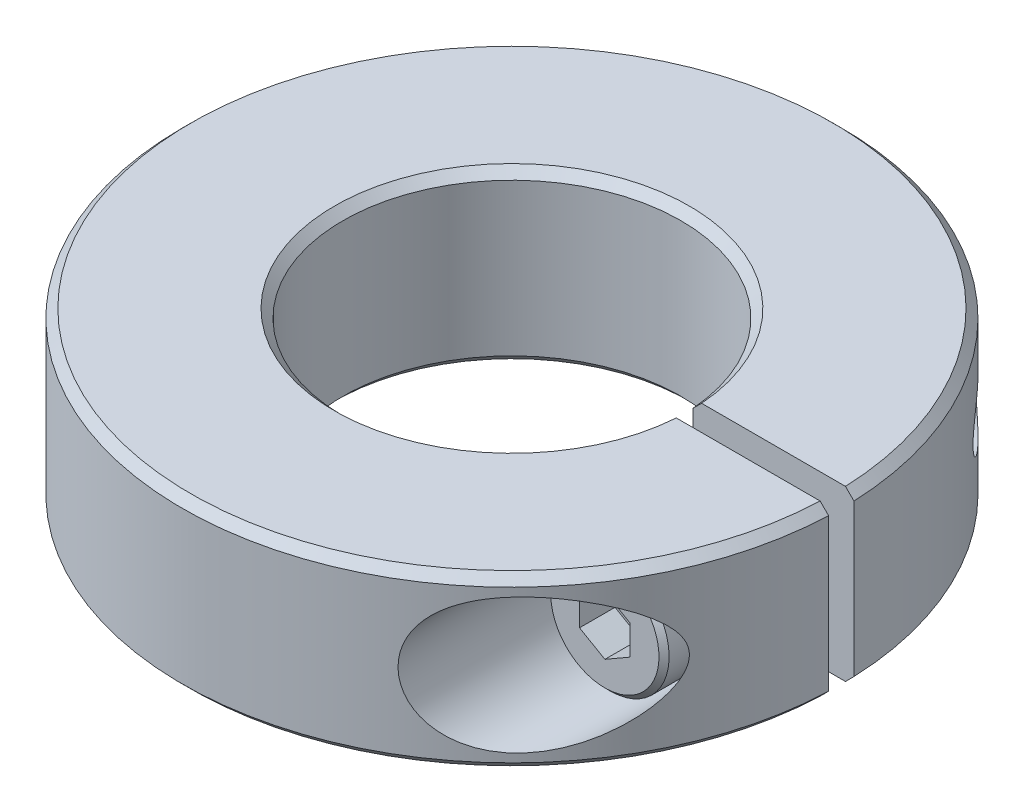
ISO-10303-21;
HEADER;
FILE_DESCRIPTION(('STEP AP214'),'2;1');
FILE_NAME('part.step','',(''),(''),'','','');
FILE_SCHEMA(('AUTOMOTIVE_DESIGN { 1 0 10303 214 1 1 1 1 }'));
ENDSEC;
DATA;
#1=APPLICATION_CONTEXT('core data for automotive mechanical design processes');
#2=APPLICATION_PROTOCOL_DEFINITION('international standard','automotive_design',2000,#1);
#3=PRODUCT_CONTEXT('',#1,'mechanical');
#4=PRODUCT('Part','Part','',(#3));
#5=PRODUCT_RELATED_PRODUCT_CATEGORY('part','',(#4));
#6=PRODUCT_DEFINITION_FORMATION('','',#4);
#7=PRODUCT_DEFINITION_CONTEXT('part definition',#1,'design');
#8=PRODUCT_DEFINITION('design','',#6,#7);
#9=PRODUCT_DEFINITION_SHAPE('','',#8);
#10=(LENGTH_UNIT() NAMED_UNIT(*) SI_UNIT(.MILLI.,.METRE.));
#11=(NAMED_UNIT(*) PLANE_ANGLE_UNIT() SI_UNIT($,.RADIAN.));
#12=(NAMED_UNIT(*) SI_UNIT($,.STERADIAN.) SOLID_ANGLE_UNIT());
#13=UNCERTAINTY_MEASURE_WITH_UNIT(LENGTH_MEASURE(1.E-05),#10,'distance_accuracy_value','');
#14=(GEOMETRIC_REPRESENTATION_CONTEXT(3) GLOBAL_UNCERTAINTY_ASSIGNED_CONTEXT((#13)) GLOBAL_UNIT_ASSIGNED_CONTEXT((#10,
#11,#12)) REPRESENTATION_CONTEXT('',''));
#15=CARTESIAN_POINT('',(0.,0.,0.));
#16=DIRECTION('',(0.,0.,1.));
#17=DIRECTION('',(1.,0.,0.));
#18=AXIS2_PLACEMENT_3D('',#15,#16,#17);
#19=CARTESIAN_POINT('',(16.25,5.,4.5));
#20=DIRECTION('',(0.,0.,-1.));
#21=DIRECTION('',(-1.,0.,0.));
#22=AXIS2_PLACEMENT_3D('',#19,#20,#21);
#23=PLANE('',#22);
#24=CARTESIAN_POINT('',(14.,5.,4.5));
#25=DIRECTION('',(0.,0.,1.));
#26=DIRECTION('',(1.,0.,0.));
#27=AXIS2_PLACEMENT_3D('',#24,#25,#26);
#28=CIRCLE('',#27,3.99999999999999);
#29=CARTESIAN_POINT('',(18.,5.,4.5));
#30=VERTEX_POINT('',#29);
#31=EDGE_CURVE('P0_E19',#30,#30,#28,.T.);
#32=ORIENTED_EDGE('',*,*,#31,.T.);
#33=EDGE_LOOP('',(#32));
#34=FACE_BOUND('',#33,.T.);
#35=CARTESIAN_POINT('',(14.,5.,4.5));
#36=DIRECTION('',(0.,0.,1.));
#37=DIRECTION('',(1.,0.,0.));
#38=AXIS2_PLACEMENT_3D('',#35,#36,#37);
#39=CIRCLE('',#38,2.25);
#40=CARTESIAN_POINT('',(16.25,5.,4.5));
#41=VERTEX_POINT('',#40);
#42=EDGE_CURVE('P0_E387',#41,#41,#39,.F.);
#43=ORIENTED_EDGE('',*,*,#42,.T.);
#44=EDGE_LOOP('',(#43));
#45=FACE_BOUND('',#44,.T.);
#46=ADVANCED_FACE('P0_F16',(#34,#45),#23,.F.);
#47=CARTESIAN_POINT('',(14.,5.,19.5));
#48=DIRECTION('',(0.,0.,1.));
#49=DIRECTION('',(1.,0.,0.));
#50=AXIS2_PLACEMENT_3D('',#47,#48,#49);
#51=CYLINDRICAL_SURFACE('',#50,3.99999999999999);
#52=CARTESIAN_POINT('',(18.,5.,7.50000000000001));
#53=CARTESIAN_POINT('',(17.9999928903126,4.9009382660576,7.50001954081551));
#54=CARTESIAN_POINT('',(17.9962706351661,4.80178356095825,7.50896960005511));
#55=CARTESIAN_POINT('',(17.981845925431,4.60689889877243,7.54344311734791));
#56=CARTESIAN_POINT('',(17.971128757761,4.5111766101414,7.56900150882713));
#57=CARTESIAN_POINT('',(17.9397041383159,4.29738461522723,7.64323621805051));
#58=CARTESIAN_POINT('',(17.9169602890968,4.18126394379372,7.69655608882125));
#59=CARTESIAN_POINT('',(17.8639752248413,3.95942356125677,7.81874776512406));
#60=CARTESIAN_POINT('',(17.8337145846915,3.85373180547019,7.88765982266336));
#61=CARTESIAN_POINT('',(17.7701460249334,3.66003010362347,8.02978809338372));
#62=CARTESIAN_POINT('',(17.7372773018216,3.57128187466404,8.10221554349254));
#63=CARTESIAN_POINT('',(17.6675458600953,3.40074950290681,8.25316573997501));
#64=CARTESIAN_POINT('',(17.6306796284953,3.31897160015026,8.33169383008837));
#65=CARTESIAN_POINT('',(17.5534597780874,3.16134929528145,8.49317865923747));
#66=CARTESIAN_POINT('',(17.5130991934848,3.08551734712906,8.5761441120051));
#67=CARTESIAN_POINT('',(17.4293016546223,2.93917505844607,8.74519021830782));
#68=CARTESIAN_POINT('',(17.3858635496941,2.86866672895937,8.83127203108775));
#69=CARTESIAN_POINT('',(17.2951657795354,2.73089575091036,9.00762393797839));
#70=CARTESIAN_POINT('',(17.2478426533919,2.66374000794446,9.09794459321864));
#71=CARTESIAN_POINT('',(17.1504091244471,2.53392991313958,9.28031089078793));
#72=CARTESIAN_POINT('',(17.1002982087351,2.47127639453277,9.37235684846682));
#73=CARTESIAN_POINT('',(16.9458979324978,2.28945897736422,9.6504639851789));
#74=CARTESIAN_POINT('',(16.8375917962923,2.17651403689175,9.83839514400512));
#75=CARTESIAN_POINT('',(16.6107415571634,1.96552867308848,10.2167537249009));
#76=CARTESIAN_POINT('',(16.4921841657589,1.86750806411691,10.4071841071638));
#77=CARTESIAN_POINT('',(16.2452266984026,1.68602481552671,10.7886157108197));
#78=CARTESIAN_POINT('',(16.116826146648,1.60256288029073,10.979616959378));
#79=CARTESIAN_POINT('',(15.8412778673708,1.44520559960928,11.3739027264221));
#80=CARTESIAN_POINT('',(15.6934483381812,1.37235916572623,11.5771311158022));
#81=CARTESIAN_POINT('',(15.3871134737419,1.24454264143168,11.9812787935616));
#82=CARTESIAN_POINT('',(15.2286052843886,1.18957735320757,12.1821974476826));
#83=CARTESIAN_POINT('',(14.9018854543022,1.09932613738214,12.5797396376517));
#84=CARTESIAN_POINT('',(14.733698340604,1.06399269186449,12.7763724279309));
#85=CARTESIAN_POINT('',(14.3882154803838,1.01506611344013,13.1642161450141));
#86=CARTESIAN_POINT('',(14.2109249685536,1.00146062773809,13.3554300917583));
#87=CARTESIAN_POINT('',(13.9116633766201,0.999230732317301,13.6654539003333));
#88=CARTESIAN_POINT('',(13.791869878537,1.00357014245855,13.7863408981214));
#89=CARTESIAN_POINT('',(13.549654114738,1.02357532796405,14.0244675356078));
#90=CARTESIAN_POINT('',(13.427232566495,1.03923804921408,14.1417081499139));
#91=CARTESIAN_POINT('',(13.1806207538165,1.08282264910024,14.3718349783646));
#92=CARTESIAN_POINT('',(13.0564318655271,1.1107354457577,14.4847243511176));
#93=CARTESIAN_POINT('',(12.8073063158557,1.17976486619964,14.7054631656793));
#94=CARTESIAN_POINT('',(12.68236981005,1.22087883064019,14.8133136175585));
#95=CARTESIAN_POINT('',(12.3580645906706,1.34626283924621,15.0862849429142));
#96=CARTESIAN_POINT('',(12.1590198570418,1.4416249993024,15.2469360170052));
#97=CARTESIAN_POINT('',(11.7697234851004,1.67180332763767,15.5494151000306));
#98=CARTESIAN_POINT('',(11.5794616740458,1.80657245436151,15.6912652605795));
#99=CARTESIAN_POINT('',(11.2473510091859,2.09098974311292,15.9305305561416));
#100=CARTESIAN_POINT('',(11.1027204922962,2.234406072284,16.0314108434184));
#101=CARTESIAN_POINT('',(10.9002175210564,2.46976038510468,16.1691677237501));
#102=CARTESIAN_POINT('',(10.8350925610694,2.55163289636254,16.2128459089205));
#103=CARTESIAN_POINT('',(10.7104840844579,2.72180184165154,16.295431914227));
#104=CARTESIAN_POINT('',(10.6509981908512,2.81009554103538,16.3343417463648));
#105=CARTESIAN_POINT('',(10.5381085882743,2.99327079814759,16.4074015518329));
#106=CARTESIAN_POINT('',(10.4847479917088,3.08819228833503,16.4415181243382));
#107=CARTESIAN_POINT('',(10.3853908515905,3.28343619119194,16.5044574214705));
#108=CARTESIAN_POINT('',(10.3393907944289,3.38375599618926,16.5332826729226));
#109=CARTESIAN_POINT('',(10.255494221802,3.58898912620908,16.585453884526));
#110=CARTESIAN_POINT('',(10.2175898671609,3.69389788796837,16.6088051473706));
#111=CARTESIAN_POINT('',(10.1504652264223,3.90747397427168,16.6499129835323));
#112=CARTESIAN_POINT('',(10.1212419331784,4.01613998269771,16.6676714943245));
#113=CARTESIAN_POINT('',(10.0647196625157,4.26866554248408,16.701881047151));
#114=CARTESIAN_POINT('',(10.0405045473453,4.41349109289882,16.7164175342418));
#115=CARTESIAN_POINT('',(10.0081475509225,4.70556251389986,16.735810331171));
#116=CARTESIAN_POINT('',(10.000003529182,4.85280805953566,16.7406679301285));
#117=CARTESIAN_POINT('',(9.99999761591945,5.09943308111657,16.7406697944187));
#118=CARTESIAN_POINT('',(10.0037101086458,5.19884169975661,16.7384543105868));
#119=CARTESIAN_POINT('',(10.0185057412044,5.39694353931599,16.7296031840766));
#120=CARTESIAN_POINT('',(10.0295903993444,5.49563660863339,16.7229666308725));
#121=CARTESIAN_POINT('',(10.0589939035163,5.69158774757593,16.7052965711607));
#122=CARTESIAN_POINT('',(10.0773164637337,5.78884505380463,16.6942608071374));
#123=CARTESIAN_POINT('',(10.1209591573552,5.98121051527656,16.6678383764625));
#124=CARTESIAN_POINT('',(10.1462819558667,6.07631783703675,16.6524500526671));
#125=CARTESIAN_POINT('',(10.2035204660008,6.26344221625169,16.6174393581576));
#126=CARTESIAN_POINT('',(10.2354183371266,6.35546686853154,16.5978284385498));
#127=CARTESIAN_POINT('',(10.3054424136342,6.53611430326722,16.5544420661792));
#128=CARTESIAN_POINT('',(10.3435709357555,6.62473580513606,16.5306650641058));
#129=CARTESIAN_POINT('',(10.4665943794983,6.88458750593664,16.4532608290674));
#130=CARTESIAN_POINT('',(10.5601911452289,7.05001032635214,16.3935219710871));
#131=CARTESIAN_POINT('',(10.7699171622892,7.36729597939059,16.2565392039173));
#132=CARTESIAN_POINT('',(10.8867362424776,7.51845632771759,16.1787425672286));
#133=CARTESIAN_POINT('',(11.135588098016,7.79825259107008,16.0084789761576));
#134=CARTESIAN_POINT('',(11.2676253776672,7.92688180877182,15.9160076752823));
#135=CARTESIAN_POINT('',(11.5586010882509,8.17496558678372,15.7061963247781));
#136=CARTESIAN_POINT('',(11.7188645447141,8.29145220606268,15.5872026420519));
#137=CARTESIAN_POINT('',(12.0465509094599,8.49591059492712,15.3353623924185));
#138=CARTESIAN_POINT('',(12.2139788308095,8.58386201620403,15.2025060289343));
#139=CARTESIAN_POINT('',(12.5092511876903,8.71441572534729,14.9598009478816));
#140=CARTESIAN_POINT('',(12.6366126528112,8.76285532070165,14.8524196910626));
#141=CARTESIAN_POINT('',(12.8911502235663,8.84556393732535,14.6320393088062));
#142=CARTESIAN_POINT('',(13.0183262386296,8.87982747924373,14.5190380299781));
#143=CARTESIAN_POINT('',(13.2713610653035,8.93521126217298,14.2881197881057));
#144=CARTESIAN_POINT('',(13.397217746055,8.95631273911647,14.1701960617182));
#145=CARTESIAN_POINT('',(13.6465065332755,8.98632767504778,13.9302839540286));
#146=CARTESIAN_POINT('',(13.7699379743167,8.99523783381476,13.8082944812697));
#147=CARTESIAN_POINT('',(14.0583312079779,9.00304390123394,13.5155314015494));
#148=CARTESIAN_POINT('',(14.2219254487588,8.99706976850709,13.343271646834));
#149=CARTESIAN_POINT('',(14.5419226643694,8.96638024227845,12.9937942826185));
#150=CARTESIAN_POINT('',(14.6983227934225,8.94165749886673,12.8165747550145));
#151=CARTESIAN_POINT('',(15.0033802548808,8.87526048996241,12.4580931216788));
#152=CARTESIAN_POINT('',(15.1520213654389,8.83355219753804,12.27682359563));
#153=CARTESIAN_POINT('',(15.4406799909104,8.73466421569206,11.9117403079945));
#154=CARTESIAN_POINT('',(15.5806987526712,8.67748676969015,11.7279269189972));
#155=CARTESIAN_POINT('',(15.8558010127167,8.5468117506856,11.3533756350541));
#156=CARTESIAN_POINT('',(15.9906186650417,8.47288406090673,11.1625929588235));
#157=CARTESIAN_POINT('',(16.2505896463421,8.31034172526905,10.7806175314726));
#158=CARTESIAN_POINT('',(16.3757402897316,8.22172301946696,10.5894246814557));
#159=CARTESIAN_POINT('',(16.6156931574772,8.03012409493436,10.2087800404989));
#160=CARTESIAN_POINT('',(16.7305282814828,7.92719241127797,10.0193245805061));
#161=CARTESIAN_POINT('',(16.9499015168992,7.70598761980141,9.64355030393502));
#162=CARTESIAN_POINT('',(17.0544464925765,7.58772486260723,9.45722946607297));
#163=CARTESIAN_POINT('',(17.2312654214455,7.36111733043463,9.13018411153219));
#164=CARTESIAN_POINT('',(17.3056415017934,7.25611832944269,8.98827872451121));
#165=CARTESIAN_POINT('',(17.4471845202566,7.03332696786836,8.71033939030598));
#166=CARTESIAN_POINT('',(17.5143379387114,6.91551141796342,8.57431672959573));
#167=CARTESIAN_POINT('',(17.6088613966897,6.72659117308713,8.37755418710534));
#168=CARTESIAN_POINT('',(17.6394767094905,6.66121463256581,8.31286323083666));
#169=CARTESIAN_POINT('',(17.6982227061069,6.52597335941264,8.18704586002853));
#170=CARTESIAN_POINT('',(17.7263524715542,6.45610698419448,8.12592076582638));
#171=CARTESIAN_POINT('',(17.7796354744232,6.31158971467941,8.00866382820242));
#172=CARTESIAN_POINT('',(17.8047979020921,6.23695475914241,7.95251670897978));
#173=CARTESIAN_POINT('',(17.8516692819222,6.0822067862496,7.8467347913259));
#174=CARTESIAN_POINT('',(17.8733809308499,6.00209811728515,7.79709491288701));
#175=CARTESIAN_POINT('',(17.9136997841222,5.83131325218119,7.70402960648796));
#176=CARTESIAN_POINT('',(17.9320631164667,5.74029594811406,7.66111197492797));
#177=CARTESIAN_POINT('',(17.9628376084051,5.5521988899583,7.58867824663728));
#178=CARTESIAN_POINT('',(17.975265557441,5.45513712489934,7.55912436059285));
#179=CARTESIAN_POINT('',(17.9893397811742,5.29767335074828,7.5255452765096));
#180=CARTESIAN_POINT('',(17.9933183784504,5.23863065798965,7.51601919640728));
#181=CARTESIAN_POINT('',(17.9986508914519,5.11973673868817,7.50324004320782));
#182=CARTESIAN_POINT('',(18.0000042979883,5.0598853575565,7.49998818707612));
#183=CARTESIAN_POINT('',(18.,5.,7.50000000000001));
#184=B_SPLINE_CURVE_WITH_KNOTS('',3,(#52,#53,#54,#55,#56,#57,#58,#59,#60,#61,#62,#63,#64,#65,
#66,#67,#68,#69,#70,#71,#72,#73,#74,#75,#76,#77,#78,#79,#80,#81,#82,#83,#84,#85,#86,#87,#88,#89,
#90,#91,#92,#93,#94,#95,#96,#97,#98,#99,#100,#101,#102,#103,#104,#105,#106,#107,#108,#109,#110,
#111,#112,#113,#114,#115,#116,#117,#118,#119,#120,#121,#122,#123,#124,#125,#126,#127,#128,#129,
#130,#131,#132,#133,#134,#135,#136,#137,#138,#139,#140,#141,#142,#143,#144,#145,#146,#147,#148,
#149,#150,#151,#152,#153,#154,#155,#156,#157,#158,#159,#160,#161,#162,#163,#164,#165,#166,#167,
#168,#169,#170,#171,#172,#173,#174,#175,#176,#177,#178,#179,#180,#181,#182,#183),.UNSPECIFIED.,
.T.,.F.,(4,2,2,2,2,2,2,2,2,2,2,2,2,2,2,2,2,2,2,2,2,2,2,2,2,2,2,2,2,2,2,2,2,2,2,2,2,2,2,2,2,2,2,
2,2,2,2,2,2,2,2,2,2,2,2,2,2,2,2,2,2,2,2,2,2,4),(0.,0.296915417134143,0.594457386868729,
0.981585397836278,1.36972443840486,1.72672652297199,2.084044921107,2.44209277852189,
2.80027522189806,3.16641505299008,3.5326224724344,4.26544049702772,4.99922312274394,
5.7330412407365,6.51719491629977,7.3015590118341,8.08401622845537,8.86602844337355,
9.37638188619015,9.88659772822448,10.3964359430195,10.9061715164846,11.7217900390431,
12.5364388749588,13.2151984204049,13.5549434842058,13.8945446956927,14.2364059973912,
14.5781036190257,14.9194688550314,15.2607157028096,15.7021491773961,16.1435238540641,
16.4416872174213,16.7399120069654,17.0382900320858,17.3367818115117,17.6344740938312,
17.9322773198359,18.527235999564,19.1436117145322,19.7601703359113,20.4509423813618,
21.142205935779,21.6620013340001,22.1819974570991,22.7027332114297,23.2236099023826,
23.9354819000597,24.6476331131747,25.3612180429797,26.0746995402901,26.8091423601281,
27.5437884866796,28.276001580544,29.0077228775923,29.5819196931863,30.1571732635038,
30.4478222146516,30.7385781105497,31.0284084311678,31.3180111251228,31.6239326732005,
31.9289836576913,32.1084418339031,32.2879348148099),.UNSPECIFIED.);
#185=CARTESIAN_POINT('',(18.,5.,7.50000000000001));
#186=VERTEX_POINT('',#185);
#187=EDGE_CURVE('P0_E390',#186,#186,#184,.T.);
#188=ORIENTED_EDGE('',*,*,#187,.F.);
#189=EDGE_LOOP('',(#188));
#190=FACE_BOUND('',#189,.T.);
#191=ORIENTED_EDGE('',*,*,#31,.F.);
#192=EDGE_LOOP('',(#191));
#193=FACE_BOUND('',#192,.T.);
#194=ADVANCED_FACE('P0_F194',(#190,#193),#51,.F.);
#195=CARTESIAN_POINT('',(0.,0.500000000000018,0.));
#196=DIRECTION('',(0.,1.,0.));
#197=DIRECTION('',(0.,0.,1.));
#198=AXIS2_PLACEMENT_3D('',#195,#196,#197);
#199=CONICAL_SURFACE('',#198,19.5,0.785398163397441);
#200=CARTESIAN_POINT('',(0.,0.500000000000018,0.));
#201=DIRECTION('',(0.,-1.,0.));
#202=DIRECTION('',(0.,0.,-1.));
#203=AXIS2_PLACEMENT_3D('',#200,#201,#202);
#204=CIRCLE('',#203,19.5);
#205=CARTESIAN_POINT('',(19.4855715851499,0.500000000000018,-0.75));
#206=VERTEX_POINT('',#205);
#207=CARTESIAN_POINT('',(19.4855715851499,0.500000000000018,0.75));
#208=VERTEX_POINT('',#207);
#209=EDGE_CURVE('P0_E396',#206,#208,#204,.F.);
#210=ORIENTED_EDGE('',*,*,#209,.F.);
#211=CARTESIAN_POINT('',(19.4855715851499,0.500000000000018,-0.75));
#212=CARTESIAN_POINT('',(19.4021757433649,0.416665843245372,-0.75));
#213=CARTESIAN_POINT('',(19.3187794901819,0.333332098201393,-0.75));
#214=CARTESIAN_POINT('',(19.1519861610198,0.166665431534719,-0.75));
#215=CARTESIAN_POINT('',(19.0685890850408,0.0833325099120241,-0.75));
#216=CARTESIAN_POINT('',(18.9851915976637,0.,-0.75));
#217=B_SPLINE_CURVE_WITH_KNOTS('',3,(#211,#212,#213,#214,#215,#216),.UNSPECIFIED.,.F.,.F.,(4,2,
4),(0.,0.353687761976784,0.70737552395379),.UNSPECIFIED.);
#218=CARTESIAN_POINT('',(18.9851915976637,0.,-0.75));
#219=VERTEX_POINT('',#218);
#220=EDGE_CURVE('P0_E177',#206,#219,#217,.T.);
#221=ORIENTED_EDGE('',*,*,#220,.T.);
#222=CARTESIAN_POINT('',(0.,0.,0.));
#223=DIRECTION('',(0.,1.,0.));
#224=DIRECTION('',(0.,0.,1.));
#225=AXIS2_PLACEMENT_3D('',#222,#223,#224);
#226=CIRCLE('',#225,19.);
#227=CARTESIAN_POINT('',(18.9851915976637,0.,0.75));
#228=VERTEX_POINT('',#227);
#229=EDGE_CURVE('P0_E91',#228,#219,#226,.F.);
#230=ORIENTED_EDGE('',*,*,#229,.F.);
#231=CARTESIAN_POINT('',(18.9851915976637,0.,0.75));
#232=CARTESIAN_POINT('',(19.0685890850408,0.083332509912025,0.75));
#233=CARTESIAN_POINT('',(19.1519861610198,0.16666543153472,0.75));
#234=CARTESIAN_POINT('',(19.3187794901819,0.333332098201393,0.75));
#235=CARTESIAN_POINT('',(19.4021757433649,0.416665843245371,0.75));
#236=CARTESIAN_POINT('',(19.4855715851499,0.500000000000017,0.75));
#237=B_SPLINE_CURVE_WITH_KNOTS('',3,(#231,#232,#233,#234,#235,#236),.UNSPECIFIED.,.F.,.F.,(4,2,
4),(0.,0.353687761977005,0.707375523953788),.UNSPECIFIED.);
#238=EDGE_CURVE('P0_E197',#228,#208,#237,.T.);
#239=ORIENTED_EDGE('',*,*,#238,.T.);
#240=EDGE_LOOP('',(#210,#221,#230,#239));
#241=FACE_BOUND('',#240,.T.);
#242=ADVANCED_FACE('P0_F191',(#241),#199,.T.);
#243=CARTESIAN_POINT('',(0.,0.,0.));
#244=DIRECTION('',(0.,-1.,0.));
#245=DIRECTION('',(0.,0.,-1.));
#246=AXIS2_PLACEMENT_3D('',#243,#244,#245);
#247=CONICAL_SURFACE('',#246,10.5,0.785398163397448);
#248=CARTESIAN_POINT('',(0.,0.500000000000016,0.));
#249=DIRECTION('',(0.,-1.,0.));
#250=DIRECTION('',(0.,0.,-1.));
#251=AXIS2_PLACEMENT_3D('',#248,#249,#250);
#252=CIRCLE('',#251,10.);
#253=CARTESIAN_POINT('',(9.97183533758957,0.500000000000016,-0.75));
#254=VERTEX_POINT('',#253);
#255=CARTESIAN_POINT('',(9.97183533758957,0.500000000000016,0.75));
#256=VERTEX_POINT('',#255);
#257=EDGE_CURVE('P0_E403',#254,#256,#252,.F.);
#258=ORIENTED_EDGE('',*,*,#257,.T.);
#259=CARTESIAN_POINT('',(10.4731800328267,0.,0.75));
#260=CARTESIAN_POINT('',(10.3896280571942,0.083338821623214,0.75));
#261=CARTESIAN_POINT('',(10.306073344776,0.166674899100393,0.75));
#262=CARTESIAN_POINT('',(10.1389584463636,0.333341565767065,0.75));
#263=CARTESIAN_POINT('',(10.0553982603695,0.416672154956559,0.75));
#264=CARTESIAN_POINT('',(9.97183533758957,0.500000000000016,0.75));
#265=B_SPLINE_CURVE_WITH_KNOTS('',3,(#259,#260,#261,#262,#263,#264),.UNSPECIFIED.,.F.,.F.,(4,2,
4),(0.,0.354029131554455,0.708058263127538),.UNSPECIFIED.);
#266=CARTESIAN_POINT('',(10.4731800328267,0.,0.75));
#267=VERTEX_POINT('',#266);
#268=EDGE_CURVE('P0_E167',#267,#256,#265,.T.);
#269=ORIENTED_EDGE('',*,*,#268,.F.);
#270=CARTESIAN_POINT('',(0.,0.,0.));
#271=DIRECTION('',(0.,-1.,0.));
#272=DIRECTION('',(0.,0.,-1.));
#273=AXIS2_PLACEMENT_3D('',#270,#271,#272);
#274=CIRCLE('',#273,10.5);
#275=CARTESIAN_POINT('',(10.4731800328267,0.,-0.75));
#276=VERTEX_POINT('',#275);
#277=EDGE_CURVE('P0_E397',#276,#267,#274,.F.);
#278=ORIENTED_EDGE('',*,*,#277,.F.);
#279=CARTESIAN_POINT('',(9.97183533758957,0.500000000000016,-0.75));
#280=CARTESIAN_POINT('',(10.0553982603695,0.416672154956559,-0.75));
#281=CARTESIAN_POINT('',(10.1389584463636,0.333341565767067,-0.75));
#282=CARTESIAN_POINT('',(10.306073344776,0.166674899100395,-0.75));
#283=CARTESIAN_POINT('',(10.3896280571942,0.0833388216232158,-0.75));
#284=CARTESIAN_POINT('',(10.4731800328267,0.,-0.75));
#285=B_SPLINE_CURVE_WITH_KNOTS('',3,(#279,#280,#281,#282,#283,#284),.UNSPECIFIED.,.F.,.F.,(4,2,
4),(0.,0.35402913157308,0.708058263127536),.UNSPECIFIED.);
#286=EDGE_CURVE('P0_E176',#254,#276,#285,.T.);
#287=ORIENTED_EDGE('',*,*,#286,.F.);
#288=EDGE_LOOP('',(#258,#269,#278,#287));
#289=FACE_BOUND('',#288,.T.);
#290=ADVANCED_FACE('P0_F188',(#289),#247,.F.);
#291=CARTESIAN_POINT('',(14.,5.,-0.75));
#292=DIRECTION('',(0.,0.,1.));
#293=DIRECTION('',(1.,0.,0.));
#294=AXIS2_PLACEMENT_3D('',#291,#292,#293);
#295=CYLINDRICAL_SURFACE('',#294,1.64999999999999);
#296=CARTESIAN_POINT('',(15.65,4.99999999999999,-11.6330348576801));
#297=CARTESIAN_POINT('',(15.6499958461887,5.06804301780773,-11.6330409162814));
#298=CARTESIAN_POINT('',(15.6457415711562,5.13611230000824,-11.6387703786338));
#299=CARTESIAN_POINT('',(15.6292362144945,5.26949905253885,-11.6609241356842));
#300=CARTESIAN_POINT('',(15.6169723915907,5.3348119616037,-11.6773654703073));
#301=CARTESIAN_POINT('',(15.5858746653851,5.46002829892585,-11.7188379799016));
#302=CARTESIAN_POINT('',(15.5671153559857,5.51998381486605,-11.7437715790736));
#303=CARTESIAN_POINT('',(15.5243246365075,5.63457184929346,-11.8002798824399));
#304=CARTESIAN_POINT('',(15.5002909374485,5.68920204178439,-11.8318574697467));
#305=CARTESIAN_POINT('',(15.4323926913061,5.82426871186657,-11.9203995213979));
#306=CARTESIAN_POINT('',(15.3852818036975,5.9005219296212,-11.9812281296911));
#307=CARTESIAN_POINT('',(15.2835721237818,6.04041053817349,-12.1107082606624));
#308=CARTESIAN_POINT('',(15.2289513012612,6.10400740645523,-12.1793826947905));
#309=CARTESIAN_POINT('',(15.1275078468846,6.20628791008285,-12.3050169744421));
#310=CARTESIAN_POINT('',(15.0818125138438,6.24732927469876,-12.3610022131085));
#311=CARTESIAN_POINT('',(14.987701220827,6.32310121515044,-12.4749464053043));
#312=CARTESIAN_POINT('',(14.939283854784,6.35782848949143,-12.532906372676));
#313=CARTESIAN_POINT('',(14.7905642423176,6.45306400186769,-12.7087640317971));
#314=CARTESIAN_POINT('',(14.6867862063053,6.50463396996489,-12.828649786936));
#315=CARTESIAN_POINT('',(14.4685387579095,6.58652146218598,-13.0743822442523));
#316=CARTESIAN_POINT('',(14.3538147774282,6.61597311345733,-13.2002843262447));
#317=CARTESIAN_POINT('',(14.1193438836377,6.64992965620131,-13.4507801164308));
#318=CARTESIAN_POINT('',(13.9995994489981,6.65444671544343,-13.5753744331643));
#319=CARTESIAN_POINT('',(13.7697872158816,6.63750734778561,-13.8082236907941));
#320=CARTESIAN_POINT('',(13.6599377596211,6.61858286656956,-13.9168734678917));
#321=CARTESIAN_POINT('',(13.4412098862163,6.5566438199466,-14.1282294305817));
#322=CARTESIAN_POINT('',(13.3323304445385,6.51365878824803,-14.2309427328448));
#323=CARTESIAN_POINT('',(13.1475236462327,6.41552638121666,-14.4015331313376));
#324=CARTESIAN_POINT('',(13.0703656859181,6.36641289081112,-14.4715425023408));
#325=CARTESIAN_POINT('',(12.9217071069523,6.25240905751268,-14.6044295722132));
#326=CARTESIAN_POINT('',(12.8501989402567,6.18754025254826,-14.6673168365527));
#327=CARTESIAN_POINT('',(12.7304051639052,6.05677422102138,-14.7713145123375));
#328=CARTESIAN_POINT('',(12.6803860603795,5.99391051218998,-14.8142316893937));
#329=CARTESIAN_POINT('',(12.588410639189,5.85825809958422,-14.8924664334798));
#330=CARTESIAN_POINT('',(12.5464477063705,5.78547762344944,-14.9277902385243));
#331=CARTESIAN_POINT('',(12.4785529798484,5.64264633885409,-14.9845715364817));
#332=CARTESIAN_POINT('',(12.4511652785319,5.57379865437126,-15.0073098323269));
#333=CARTESIAN_POINT('',(12.4055781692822,5.4311582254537,-15.0450162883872));
#334=CARTESIAN_POINT('',(12.3873627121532,5.35737437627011,-15.0599980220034));
#335=CARTESIAN_POINT('',(12.366268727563,5.23587415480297,-15.077317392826));
#336=CARTESIAN_POINT('',(12.3601854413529,5.18905904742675,-15.0823023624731));
#337=CARTESIAN_POINT('',(12.3520489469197,5.09483755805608,-15.0889666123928));
#338=CARTESIAN_POINT('',(12.3499964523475,5.04743107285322,-15.0906453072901));
#339=CARTESIAN_POINT('',(12.3500057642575,4.92293356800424,-15.0906387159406));
#340=CARTESIAN_POINT('',(12.3554394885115,4.84580222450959,-15.0861962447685));
#341=CARTESIAN_POINT('',(12.3768097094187,4.69397528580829,-15.0686681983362));
#342=CARTESIAN_POINT('',(12.3927599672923,4.61928301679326,-15.0555712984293));
#343=CARTESIAN_POINT('',(12.434009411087,4.47484307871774,-15.0215216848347));
#344=CARTESIAN_POINT('',(12.4592649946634,4.40507412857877,-15.0006056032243));
#345=CARTESIAN_POINT('',(12.517696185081,4.27158302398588,-14.951880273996));
#346=CARTESIAN_POINT('',(12.5508721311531,4.207861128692,-14.9240707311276));
#347=CARTESIAN_POINT('',(12.6260732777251,4.0832253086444,-14.8605130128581));
#348=CARTESIAN_POINT('',(12.6685453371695,4.02279306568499,-14.8243550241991));
#349=CARTESIAN_POINT('',(12.7590115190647,3.91019549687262,-14.746565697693));
#350=CARTESIAN_POINT('',(12.8070087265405,3.85803482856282,-14.7049313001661));
#351=CARTESIAN_POINT('',(12.9334923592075,3.73655331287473,-14.5940070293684));
#352=CARTESIAN_POINT('',(13.0146805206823,3.67274293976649,-14.521734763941));
#353=CARTESIAN_POINT('',(13.1822837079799,3.56337171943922,-14.3697703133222));
#354=CARTESIAN_POINT('',(13.2687104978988,3.51785384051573,-14.2900611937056));
#355=CARTESIAN_POINT('',(13.4726233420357,3.43145140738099,-14.0983619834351));
#356=CARTESIAN_POINT('',(13.5909693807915,3.39702292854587,-13.9843820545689));
#357=CARTESIAN_POINT('',(13.826970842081,3.35471500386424,-13.7510925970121));
#358=CARTESIAN_POINT('',(13.9446256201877,3.34685730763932,-13.6317787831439));
#359=CARTESIAN_POINT('',(14.1787038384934,3.35544725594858,-13.3881833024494));
#360=CARTESIAN_POINT('',(14.2950538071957,3.37239150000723,-13.2638499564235));
#361=CARTESIAN_POINT('',(14.5217446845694,3.43029083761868,-13.0152696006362));
#362=CARTESIAN_POINT('',(14.6320845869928,3.47124993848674,-12.8910226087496));
#363=CARTESIAN_POINT('',(14.831356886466,3.57095426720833,-12.6610033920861));
#364=CARTESIAN_POINT('',(14.9212465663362,3.62686113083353,-12.5548520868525));
#365=CARTESIAN_POINT('',(15.0496480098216,3.72577734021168,-12.4001055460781));
#366=CARTESIAN_POINT('',(15.0913609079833,3.76124153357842,-12.349289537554));
#367=CARTESIAN_POINT('',(15.1722764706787,3.83752007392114,-12.2497399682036));
#368=CARTESIAN_POINT('',(15.2114804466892,3.87833159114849,-12.2010053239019));
#369=CARTESIAN_POINT('',(15.2952568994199,3.97540785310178,-12.0958906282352));
#370=CARTESIAN_POINT('',(15.3390910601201,4.0330923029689,-12.0402128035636));
#371=CARTESIAN_POINT('',(15.4208429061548,4.15782932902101,-11.9353260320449));
#372=CARTESIAN_POINT('',(15.458768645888,4.22486891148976,-11.8861082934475));
#373=CARTESIAN_POINT('',(15.5184487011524,4.3515641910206,-11.808029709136));
#374=CARTESIAN_POINT('',(15.5419002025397,4.40913748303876,-11.777117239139));
#375=CARTESIAN_POINT('',(15.5828462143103,4.52974995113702,-11.7228861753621));
#376=CARTESIAN_POINT('',(15.6003494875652,4.5927809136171,-11.6995564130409));
#377=CARTESIAN_POINT('',(15.6257841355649,4.71283082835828,-11.6655583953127));
#378=CARTESIAN_POINT('',(15.6347952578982,4.76921109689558,-11.6534663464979));
#379=CARTESIAN_POINT('',(15.6469031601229,4.88372191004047,-11.6372044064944));
#380=CARTESIAN_POINT('',(15.6500035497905,4.9418513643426,-11.633029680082));
#381=CARTESIAN_POINT('',(15.65,4.99999999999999,-11.6330348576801));
#382=B_SPLINE_CURVE_WITH_KNOTS('',3,(#296,#297,#298,#299,#300,#301,#302,#303,#304,#305,#306,
#307,#308,#309,#310,#311,#312,#313,#314,#315,#316,#317,#318,#319,#320,#321,#322,#323,#324,#325,
#326,#327,#328,#329,#330,#331,#332,#333,#334,#335,#336,#337,#338,#339,#340,#341,#342,#343,#344,
#345,#346,#347,#348,#349,#350,#351,#352,#353,#354,#355,#356,#357,#358,#359,#360,#361,#362,#363,
#364,#365,#366,#367,#368,#369,#370,#371,#372,#373,#374,#375,#376,#377,#378,#379,#380,#381),
.UNSPECIFIED.,.T.,.F.,(4,2,2,2,2,2,2,2,2,2,2,2,2,2,2,2,2,2,2,2,2,2,2,2,2,2,2,2,2,2,2,2,2,2,2,2,
2,2,2,2,2,2,4),(0.,0.20383158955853,0.407988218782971,0.609874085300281,0.811847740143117,
1.13500640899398,1.45913412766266,1.70812765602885,1.95725100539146,2.4554518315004,
2.9722634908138,3.48882293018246,3.95414324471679,4.41889363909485,4.76326883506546,
5.10717588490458,5.37938935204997,5.65137833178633,5.88292648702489,6.11406806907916,
6.25621538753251,6.39838787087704,6.62939099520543,6.86069699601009,7.09093266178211,
7.32117819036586,7.56700180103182,7.81296334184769,8.18898364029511,8.56588210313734,
9.06683257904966,9.56819301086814,10.0797303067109,10.5913529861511,11.0394777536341,
11.2633610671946,11.4871263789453,11.7605302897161,12.0335581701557,12.2411358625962,
12.4484064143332,12.6227045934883,12.7968962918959),.UNSPECIFIED.);
#383=CARTESIAN_POINT('',(15.65,4.99999999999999,-11.6330348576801));
#384=VERTEX_POINT('',#383);
#385=EDGE_CURVE('P0_E381',#384,#384,#382,.T.);
#386=ORIENTED_EDGE('',*,*,#385,.F.);
#387=EDGE_LOOP('',(#386));
#388=FACE_BOUND('',#387,.T.);
#389=CARTESIAN_POINT('',(14.,5.,-0.749999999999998));
#390=DIRECTION('',(0.,0.,1.));
#391=DIRECTION('',(1.,0.,0.));
#392=AXIS2_PLACEMENT_3D('',#389,#390,#391);
#393=CIRCLE('',#392,1.64999999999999);
#394=CARTESIAN_POINT('',(15.65,5.,-0.749999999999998));
#395=VERTEX_POINT('',#394);
#396=EDGE_CURVE('P0_E404',#395,#395,#393,.T.);
#397=ORIENTED_EDGE('',*,*,#396,.T.);
#398=EDGE_LOOP('',(#397));
#399=FACE_BOUND('',#398,.T.);
#400=ADVANCED_FACE('P0_F280',(#388,#399),#295,.F.);
#401=CARTESIAN_POINT('',(14.,5.,19.5));
#402=DIRECTION('',(0.,0.,1.));
#403=DIRECTION('',(1.,0.,0.));
#404=AXIS2_PLACEMENT_3D('',#401,#402,#403);
#405=CYLINDRICAL_SURFACE('',#404,2.25);
#406=CARTESIAN_POINT('',(14.,5.,0.750000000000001));
#407=DIRECTION('',(0.,0.,1.));
#408=DIRECTION('',(1.,0.,0.));
#409=AXIS2_PLACEMENT_3D('',#406,#407,#408);
#410=CIRCLE('',#409,2.25);
#411=CARTESIAN_POINT('',(16.25,5.,0.750000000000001));
#412=VERTEX_POINT('',#411);
#413=EDGE_CURVE('P0_E414',#412,#412,#410,.F.);
#414=ORIENTED_EDGE('',*,*,#413,.T.);
#415=EDGE_LOOP('',(#414));
#416=FACE_BOUND('',#415,.T.);
#417=ORIENTED_EDGE('',*,*,#42,.F.);
#418=EDGE_LOOP('',(#417));
#419=FACE_BOUND('',#418,.T.);
#420=ADVANCED_FACE('P0_F243',(#416,#419),#405,.F.);
#421=CARTESIAN_POINT('',(0.,0.,0.));
#422=DIRECTION('',(0.,-1.,0.));
#423=DIRECTION('',(0.,0.,-1.));
#424=AXIS2_PLACEMENT_3D('',#421,#422,#423);
#425=CYLINDRICAL_SURFACE('',#424,19.5);
#426=ORIENTED_EDGE('',*,*,#209,.T.);
#427=DIRECTION('',(0.,1.,0.));
#428=VECTOR('',#427,1.);
#429=CARTESIAN_POINT('',(19.4855715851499,0.,0.75));
#430=LINE('',#429,#428);
#431=CARTESIAN_POINT('',(19.4855715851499,9.49999999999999,0.75));
#432=VERTEX_POINT('',#431);
#433=EDGE_CURVE('P0_E416',#208,#432,#430,.T.);
#434=ORIENTED_EDGE('',*,*,#433,.T.);
#435=CARTESIAN_POINT('',(0.,9.49999999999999,0.));
#436=DIRECTION('',(0.,-1.,0.));
#437=DIRECTION('',(0.,0.,-1.));
#438=AXIS2_PLACEMENT_3D('',#435,#436,#437);
#439=CIRCLE('',#438,19.5);
#440=CARTESIAN_POINT('',(19.4855715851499,9.49999999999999,-0.75));
#441=VERTEX_POINT('',#440);
#442=EDGE_CURVE('P0_E413',#441,#432,#439,.F.);
#443=ORIENTED_EDGE('',*,*,#442,.F.);
#444=DIRECTION('',(0.,1.,0.));
#445=VECTOR('',#444,1.);
#446=CARTESIAN_POINT('',(19.4855715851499,0.,-0.75));
#447=LINE('',#446,#445);
#448=EDGE_CURVE('P0_E408',#441,#206,#447,.F.);
#449=ORIENTED_EDGE('',*,*,#448,.T.);
#450=EDGE_LOOP('',(#426,#434,#443,#449));
#451=FACE_BOUND('',#450,.T.);
#452=ORIENTED_EDGE('',*,*,#187,.T.);
#453=EDGE_LOOP('',(#452));
#454=FACE_BOUND('',#453,.T.);
#455=ORIENTED_EDGE('',*,*,#385,.T.);
#456=EDGE_LOOP('',(#455));
#457=FACE_BOUND('',#456,.T.);
#458=ADVANCED_FACE('P0_F240',(#451,#454,#457),#425,.T.);
#459=CARTESIAN_POINT('',(10.,0.,0.));
#460=DIRECTION('',(0.,-1.,0.));
#461=DIRECTION('',(0.,0.,-1.));
#462=AXIS2_PLACEMENT_3D('',#459,#460,#461);
#463=PLANE('',#462);
#464=DIRECTION('',(1.,0.,0.));
#465=VECTOR('',#464,1.);
#466=CARTESIAN_POINT('',(0.,0.,0.75));
#467=LINE('',#466,#465);
#468=EDGE_CURVE('P0_E133',#267,#228,#467,.T.);
#469=ORIENTED_EDGE('',*,*,#468,.T.);
#470=ORIENTED_EDGE('',*,*,#229,.T.);
#471=DIRECTION('',(-1.,0.,0.));
#472=VECTOR('',#471,1.);
#473=CARTESIAN_POINT('',(0.,0.,-0.75));
#474=LINE('',#473,#472);
#475=EDGE_CURVE('P0_E439',#219,#276,#474,.T.);
#476=ORIENTED_EDGE('',*,*,#475,.T.);
#477=ORIENTED_EDGE('',*,*,#277,.T.);
#478=EDGE_LOOP('',(#469,#470,#476,#477));
#479=FACE_BOUND('',#478,.T.);
#480=ADVANCED_FACE('P0_F242',(#479),#463,.T.);
#481=CARTESIAN_POINT('',(0.,0.,0.));
#482=DIRECTION('',(0.,-1.,0.));
#483=DIRECTION('',(0.,0.,-1.));
#484=AXIS2_PLACEMENT_3D('',#481,#482,#483);
#485=CYLINDRICAL_SURFACE('',#484,10.);
#486=CARTESIAN_POINT('',(0.,9.5,0.));
#487=DIRECTION('',(0.,1.,0.));
#488=DIRECTION('',(0.,0.,1.));
#489=AXIS2_PLACEMENT_3D('',#486,#487,#488);
#490=CIRCLE('',#489,10.);
#491=CARTESIAN_POINT('',(9.97183533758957,9.5,-0.75));
#492=VERTEX_POINT('',#491);
#493=CARTESIAN_POINT('',(9.97183533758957,9.5,0.75));
#494=VERTEX_POINT('',#493);
#495=EDGE_CURVE('P0_E99',#492,#494,#490,.T.);
#496=ORIENTED_EDGE('',*,*,#495,.T.);
#497=DIRECTION('',(0.,1.,0.));
#498=VECTOR('',#497,1.);
#499=CARTESIAN_POINT('',(9.97183533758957,0.,0.75));
#500=LINE('',#499,#498);
#501=EDGE_CURVE('P0_E447',#494,#256,#500,.F.);
#502=ORIENTED_EDGE('',*,*,#501,.T.);
#503=ORIENTED_EDGE('',*,*,#257,.F.);
#504=DIRECTION('',(0.,1.,0.));
#505=VECTOR('',#504,1.);
#506=CARTESIAN_POINT('',(9.97183533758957,0.,-0.75));
#507=LINE('',#506,#505);
#508=EDGE_CURVE('P0_E103',#254,#492,#507,.T.);
#509=ORIENTED_EDGE('',*,*,#508,.T.);
#510=EDGE_LOOP('',(#496,#502,#503,#509));
#511=FACE_BOUND('',#510,.T.);
#512=ADVANCED_FACE('P0_F235',(#511),#485,.F.);
#513=CARTESIAN_POINT('',(0.,0.,-0.75));
#514=DIRECTION('',(0.,0.,-1.));
#515=DIRECTION('',(-1.,0.,0.));
#516=AXIS2_PLACEMENT_3D('',#513,#514,#515);
#517=PLANE('',#516);
#518=ORIENTED_EDGE('',*,*,#396,.F.);
#519=EDGE_LOOP('',(#518));
#520=FACE_BOUND('',#519,.T.);
#521=ORIENTED_EDGE('',*,*,#448,.F.);
#522=CARTESIAN_POINT('',(18.9851915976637,10.,-0.75));
#523=CARTESIAN_POINT('',(19.0685890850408,9.91666749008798,-0.75));
#524=CARTESIAN_POINT('',(19.1519861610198,9.83333456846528,-0.75));
#525=CARTESIAN_POINT('',(19.3187794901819,9.66666790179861,-0.75));
#526=CARTESIAN_POINT('',(19.4021757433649,9.58333415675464,-0.75));
#527=CARTESIAN_POINT('',(19.4855715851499,9.49999999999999,-0.75));
#528=B_SPLINE_CURVE_WITH_KNOTS('',3,(#522,#523,#524,#525,#526,#527),.UNSPECIFIED.,.F.,.F.,(4,2,
4),(0.,0.353687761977,0.707375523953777),.UNSPECIFIED.);
#529=CARTESIAN_POINT('',(18.9851915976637,10.,-0.75));
#530=VERTEX_POINT('',#529);
#531=EDGE_CURVE('P0_E119',#530,#441,#528,.T.);
#532=ORIENTED_EDGE('',*,*,#531,.F.);
#533=DIRECTION('',(1.,0.,0.));
#534=VECTOR('',#533,1.);
#535=CARTESIAN_POINT('',(10.,10.,-0.75));
#536=LINE('',#535,#534);
#537=CARTESIAN_POINT('',(10.4731800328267,10.,-0.75));
#538=VERTEX_POINT('',#537);
#539=EDGE_CURVE('P0_E111',#538,#530,#536,.T.);
#540=ORIENTED_EDGE('',*,*,#539,.F.);
#541=CARTESIAN_POINT('',(10.4731800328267,10.,-0.75));
#542=CARTESIAN_POINT('',(10.3896280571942,9.91666117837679,-0.75));
#543=CARTESIAN_POINT('',(10.306073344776,9.83332510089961,-0.75));
#544=CARTESIAN_POINT('',(10.1389584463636,9.66665843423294,-0.75));
#545=CARTESIAN_POINT('',(10.0553982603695,9.58332784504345,-0.75));
#546=CARTESIAN_POINT('',(9.97183533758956,9.5,-0.75));
#547=B_SPLINE_CURVE_WITH_KNOTS('',3,(#541,#542,#543,#544,#545,#546),.UNSPECIFIED.,.F.,.F.,(4,2,
4),(0.,0.354029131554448,0.708058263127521),.UNSPECIFIED.);
#548=EDGE_CURVE('P0_E117',#538,#492,#547,.T.);
#549=ORIENTED_EDGE('',*,*,#548,.T.);
#550=ORIENTED_EDGE('',*,*,#508,.F.);
#551=ORIENTED_EDGE('',*,*,#286,.T.);
#552=ORIENTED_EDGE('',*,*,#475,.F.);
#553=ORIENTED_EDGE('',*,*,#220,.F.);
#554=EDGE_LOOP('',(#521,#532,#540,#549,#550,#551,#552,#553));
#555=FACE_BOUND('',#554,.T.);
#556=ADVANCED_FACE('P0_F116',(#520,#555),#517,.F.);
#557=CARTESIAN_POINT('',(0.,9.49999999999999,0.));
#558=DIRECTION('',(0.,-1.,0.));
#559=DIRECTION('',(0.,0.,-1.));
#560=AXIS2_PLACEMENT_3D('',#557,#558,#559);
#561=CONICAL_SURFACE('',#560,19.5,0.785398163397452);
#562=ORIENTED_EDGE('',*,*,#442,.T.);
#563=CARTESIAN_POINT('',(19.4855715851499,9.5,0.75));
#564=CARTESIAN_POINT('',(19.4021757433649,9.58333415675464,0.75));
#565=CARTESIAN_POINT('',(19.3187794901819,9.66666790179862,0.75));
#566=CARTESIAN_POINT('',(19.1519861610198,9.83333456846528,0.75));
#567=CARTESIAN_POINT('',(19.0685890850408,9.91666749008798,0.75));
#568=CARTESIAN_POINT('',(18.9851915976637,10.,0.75));
#569=B_SPLINE_CURVE_WITH_KNOTS('',3,(#563,#564,#565,#566,#567,#568),.UNSPECIFIED.,.F.,.F.,(4,2,
4),(0.,0.353687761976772,0.707375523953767),.UNSPECIFIED.);
#570=CARTESIAN_POINT('',(18.9851915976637,10.,0.75));
#571=VERTEX_POINT('',#570);
#572=EDGE_CURVE('P0_E160',#432,#571,#569,.T.);
#573=ORIENTED_EDGE('',*,*,#572,.T.);
#574=CARTESIAN_POINT('',(0.,10.,0.));
#575=DIRECTION('',(0.,-1.,0.));
#576=DIRECTION('',(0.,0.,-1.));
#577=AXIS2_PLACEMENT_3D('',#574,#575,#576);
#578=CIRCLE('',#577,19.);
#579=EDGE_CURVE('P0_E122',#530,#571,#578,.F.);
#580=ORIENTED_EDGE('',*,*,#579,.F.);
#581=ORIENTED_EDGE('',*,*,#531,.T.);
#582=EDGE_LOOP('',(#562,#573,#580,#581));
#583=FACE_BOUND('',#582,.T.);
#584=ADVANCED_FACE('P0_F156',(#583),#561,.T.);
#585=CARTESIAN_POINT('',(0.,0.,0.75));
#586=DIRECTION('',(0.,0.,1.));
#587=DIRECTION('',(1.,0.,0.));
#588=AXIS2_PLACEMENT_3D('',#585,#586,#587);
#589=PLANE('',#588);
#590=ORIENTED_EDGE('',*,*,#468,.F.);
#591=ORIENTED_EDGE('',*,*,#268,.T.);
#592=ORIENTED_EDGE('',*,*,#501,.F.);
#593=CARTESIAN_POINT('',(9.97183533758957,9.5,0.75));
#594=CARTESIAN_POINT('',(10.0553982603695,9.58332784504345,0.75));
#595=CARTESIAN_POINT('',(10.1389584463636,9.66665843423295,0.75));
#596=CARTESIAN_POINT('',(10.306073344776,9.83332510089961,0.75));
#597=CARTESIAN_POINT('',(10.3896280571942,9.91666117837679,0.75));
#598=CARTESIAN_POINT('',(10.4731800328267,10.,0.75));
#599=B_SPLINE_CURVE_WITH_KNOTS('',3,(#593,#594,#595,#596,#597,#598),.UNSPECIFIED.,.F.,.F.,(4,2,
4),(0.,0.354029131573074,0.708058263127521),.UNSPECIFIED.);
#600=CARTESIAN_POINT('',(10.4731800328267,10.,0.75));
#601=VERTEX_POINT('',#600);
#602=EDGE_CURVE('P0_E39',#494,#601,#599,.T.);
#603=ORIENTED_EDGE('',*,*,#602,.T.);
#604=DIRECTION('',(1.,0.,0.));
#605=VECTOR('',#604,1.);
#606=CARTESIAN_POINT('',(10.,10.,0.75));
#607=LINE('',#606,#605);
#608=EDGE_CURVE('P0_E26',#571,#601,#607,.F.);
#609=ORIENTED_EDGE('',*,*,#608,.F.);
#610=ORIENTED_EDGE('',*,*,#572,.F.);
#611=ORIENTED_EDGE('',*,*,#433,.F.);
#612=ORIENTED_EDGE('',*,*,#238,.F.);
#613=EDGE_LOOP('',(#590,#591,#592,#603,#609,#610,#611,#612));
#614=FACE_BOUND('',#613,.T.);
#615=ORIENTED_EDGE('',*,*,#413,.F.);
#616=EDGE_LOOP('',(#615));
#617=FACE_BOUND('',#616,.T.);
#618=ADVANCED_FACE('P0_F152',(#614,#617),#589,.F.);
#619=CARTESIAN_POINT('',(0.,10.,0.));
#620=DIRECTION('',(0.,1.,0.));
#621=DIRECTION('',(0.,0.,1.));
#622=AXIS2_PLACEMENT_3D('',#619,#620,#621);
#623=CONICAL_SURFACE('',#622,10.5,0.785398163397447);
#624=ORIENTED_EDGE('',*,*,#495,.F.);
#625=ORIENTED_EDGE('',*,*,#548,.F.);
#626=CARTESIAN_POINT('',(0.,10.,0.));
#627=DIRECTION('',(0.,1.,0.));
#628=DIRECTION('',(0.,0.,1.));
#629=AXIS2_PLACEMENT_3D('',#626,#627,#628);
#630=CIRCLE('',#629,10.5);
#631=EDGE_CURVE('P0_E11',#601,#538,#630,.F.);
#632=ORIENTED_EDGE('',*,*,#631,.F.);
#633=ORIENTED_EDGE('',*,*,#602,.F.);
#634=EDGE_LOOP('',(#624,#625,#632,#633));
#635=FACE_BOUND('',#634,.T.);
#636=ADVANCED_FACE('P0_F124',(#635),#623,.F.);
#637=CARTESIAN_POINT('',(10.,10.,0.));
#638=DIRECTION('',(0.,1.,0.));
#639=DIRECTION('',(0.,0.,1.));
#640=AXIS2_PLACEMENT_3D('',#637,#638,#639);
#641=PLANE('',#640);
#642=ORIENTED_EDGE('',*,*,#631,.T.);
#643=ORIENTED_EDGE('',*,*,#539,.T.);
#644=ORIENTED_EDGE('',*,*,#579,.T.);
#645=ORIENTED_EDGE('',*,*,#608,.T.);
#646=EDGE_LOOP('',(#642,#643,#644,#645));
#647=FACE_BOUND('',#646,.T.);
#648=ADVANCED_FACE('P0_F110',(#647),#641,.T.);
#649=CLOSED_SHELL('',(#46,#194,#242,#290,#400,#420,#458,#480,#512,#556,#584,#618,#636,#648));
#650=MANIFOLD_SOLID_BREP('P0_B1',#649);
#651=CARTESIAN_POINT('',(12.5,5.86602540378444,6.4));
#652=DIRECTION('',(-1.,0.,0.));
#653=DIRECTION('',(0.,0.,1.));
#654=AXIS2_PLACEMENT_3D('',#651,#652,#653);
#655=PLANE('',#654);
#656=DIRECTION('',(0.,0.,1.));
#657=VECTOR('',#656,1.);
#658=CARTESIAN_POINT('',(12.5,4.13397459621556,6.4));
#659=LINE('',#658,#657);
#660=CARTESIAN_POINT('',(12.5,4.13397459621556,8.5));
#661=VERTEX_POINT('',#660);
#662=CARTESIAN_POINT('',(12.5,4.13397459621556,6.4));
#663=VERTEX_POINT('',#662);
#664=EDGE_CURVE('P1_E104',#661,#663,#659,.F.);
#665=ORIENTED_EDGE('',*,*,#664,.T.);
#666=DIRECTION('',(0.,1.,0.));
#667=VECTOR('',#666,1.);
#668=CARTESIAN_POINT('',(12.5,5.86602540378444,6.4));
#669=LINE('',#668,#667);
#670=CARTESIAN_POINT('',(12.5,5.86602540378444,6.4));
#671=VERTEX_POINT('',#670);
#672=EDGE_CURVE('P1_E123',#671,#663,#669,.F.);
#673=ORIENTED_EDGE('',*,*,#672,.F.);
#674=DIRECTION('',(0.,0.,1.));
#675=VECTOR('',#674,1.);
#676=CARTESIAN_POINT('',(12.5,5.86602540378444,6.4));
#677=LINE('',#676,#675);
#678=CARTESIAN_POINT('',(12.5,5.86602540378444,8.5));
#679=VERTEX_POINT('',#678);
#680=EDGE_CURVE('P1_E118',#671,#679,#677,.T.);
#681=ORIENTED_EDGE('',*,*,#680,.T.);
#682=DIRECTION('',(0.,1.,0.));
#683=VECTOR('',#682,1.);
#684=CARTESIAN_POINT('',(12.5,5.86602540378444,8.5));
#685=LINE('',#684,#683);
#686=EDGE_CURVE('P1_E81',#661,#679,#685,.T.);
#687=ORIENTED_EDGE('',*,*,#686,.F.);
#688=EDGE_LOOP('',(#665,#673,#681,#687));
#689=FACE_BOUND('',#688,.T.);
#690=ADVANCED_FACE('P1_F16',(#689),#655,.F.);
#691=CARTESIAN_POINT('',(14.,5.,6.40000000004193));
#692=DIRECTION('',(0.,0.,1.));
#693=DIRECTION('',(1.,0.,0.));
#694=AXIS2_PLACEMENT_3D('',#691,#692,#693);
#695=CONICAL_SURFACE('',#694,1.32679491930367,1.04719755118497);
#696=CARTESIAN_POINT('',(13.9999999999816,5.,5.63397459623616));
#697=VERTEX_POINT('',#696);
#698=VERTEX_LOOP('',#697);
#699=FACE_BOUND('',#698,.T.);
#700=CARTESIAN_POINT('',(14.,5.,6.3999999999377));
#701=DIRECTION('',(0.,0.,1.));
#702=DIRECTION('',(1.,0.,0.));
#703=AXIS2_PLACEMENT_3D('',#700,#701,#702);
#704=CIRCLE('',#703,1.32679491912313);
#705=CARTESIAN_POINT('',(15.3267949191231,5.,6.3999999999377));
#706=VERTEX_POINT('',#705);
#707=EDGE_CURVE('P1_E19',#706,#706,#704,.F.);
#708=ORIENTED_EDGE('',*,*,#707,.F.);
#709=EDGE_LOOP('',(#708));
#710=FACE_BOUND('',#709,.T.);
#711=ADVANCED_FACE('P1_F86',(#699,#710),#695,.F.);
#712=CARTESIAN_POINT('',(14.,6.73205080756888,6.4));
#713=DIRECTION('',(-0.5,0.866025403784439,0.));
#714=DIRECTION('',(-0.866025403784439,-0.5,0.));
#715=AXIS2_PLACEMENT_3D('',#712,#713,#714);
#716=PLANE('',#715);
#717=ORIENTED_EDGE('',*,*,#680,.F.);
#718=DIRECTION('',(-0.866025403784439,-0.5,0.));
#719=VECTOR('',#718,1.);
#720=CARTESIAN_POINT('',(14.,6.73205080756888,6.4));
#721=LINE('',#720,#719);
#722=CARTESIAN_POINT('',(14.,6.73205080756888,6.4));
#723=VERTEX_POINT('',#722);
#724=EDGE_CURVE('P1_E94',#723,#671,#721,.T.);
#725=ORIENTED_EDGE('',*,*,#724,.F.);
#726=DIRECTION('',(0.,0.,1.));
#727=VECTOR('',#726,1.);
#728=CARTESIAN_POINT('',(14.,6.73205080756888,6.4));
#729=LINE('',#728,#727);
#730=CARTESIAN_POINT('',(14.,6.73205080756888,8.5));
#731=VERTEX_POINT('',#730);
#732=EDGE_CURVE('P1_E169',#723,#731,#729,.T.);
#733=ORIENTED_EDGE('',*,*,#732,.T.);
#734=DIRECTION('',(-0.866025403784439,-0.5,0.));
#735=VECTOR('',#734,1.);
#736=CARTESIAN_POINT('',(14.,6.73205080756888,8.5));
#737=LINE('',#736,#735);
#738=EDGE_CURVE('P1_E112',#679,#731,#737,.F.);
#739=ORIENTED_EDGE('',*,*,#738,.F.);
#740=EDGE_LOOP('',(#717,#725,#733,#739));
#741=FACE_BOUND('',#740,.T.);
#742=ADVANCED_FACE('P1_F89',(#741),#716,.F.);
#743=CARTESIAN_POINT('',(12.5,4.13397459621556,6.4));
#744=DIRECTION('',(-0.5,-0.866025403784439,0.));
#745=DIRECTION('',(0.866025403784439,-0.5,0.));
#746=AXIS2_PLACEMENT_3D('',#743,#744,#745);
#747=PLANE('',#746);
#748=DIRECTION('',(0.,0.,1.));
#749=VECTOR('',#748,1.);
#750=CARTESIAN_POINT('',(14.,3.26794919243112,6.4));
#751=LINE('',#750,#749);
#752=CARTESIAN_POINT('',(14.,3.26794919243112,8.5));
#753=VERTEX_POINT('',#752);
#754=CARTESIAN_POINT('',(14.,3.26794919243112,6.4));
#755=VERTEX_POINT('',#754);
#756=EDGE_CURVE('P1_E164',#753,#755,#751,.F.);
#757=ORIENTED_EDGE('',*,*,#756,.T.);
#758=DIRECTION('',(0.866025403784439,-0.5,0.));
#759=VECTOR('',#758,1.);
#760=CARTESIAN_POINT('',(12.5,4.13397459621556,6.4));
#761=LINE('',#760,#759);
#762=EDGE_CURVE('P1_E101',#663,#755,#761,.T.);
#763=ORIENTED_EDGE('',*,*,#762,.F.);
#764=ORIENTED_EDGE('',*,*,#664,.F.);
#765=DIRECTION('',(0.866025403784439,-0.5,0.));
#766=VECTOR('',#765,1.);
#767=CARTESIAN_POINT('',(12.5,4.13397459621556,8.5));
#768=LINE('',#767,#766);
#769=EDGE_CURVE('P1_E95',#753,#661,#768,.F.);
#770=ORIENTED_EDGE('',*,*,#769,.F.);
#771=EDGE_LOOP('',(#757,#763,#764,#770));
#772=FACE_BOUND('',#771,.T.);
#773=ADVANCED_FACE('P1_F197',(#772),#747,.F.);
#774=CARTESIAN_POINT('',(14.,6.73205080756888,6.4));
#775=DIRECTION('',(0.,0.,1.));
#776=DIRECTION('',(1.,0.,0.));
#777=AXIS2_PLACEMENT_3D('',#774,#775,#776);
#778=PLANE('',#777);
#779=DIRECTION('',(0.866025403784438,0.500000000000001,0.));
#780=VECTOR('',#779,1.);
#781=CARTESIAN_POINT('',(14.,3.26794919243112,6.4));
#782=LINE('',#781,#780);
#783=CARTESIAN_POINT('',(15.5,4.13397459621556,6.4));
#784=VERTEX_POINT('',#783);
#785=EDGE_CURVE('P1_E161',#755,#784,#782,.T.);
#786=ORIENTED_EDGE('',*,*,#785,.T.);
#787=DIRECTION('',(0.,1.,0.));
#788=VECTOR('',#787,1.);
#789=CARTESIAN_POINT('',(15.5,4.13397459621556,6.4));
#790=LINE('',#789,#788);
#791=CARTESIAN_POINT('',(15.5,5.86602540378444,6.4));
#792=VERTEX_POINT('',#791);
#793=EDGE_CURVE('P1_E156',#784,#792,#790,.T.);
#794=ORIENTED_EDGE('',*,*,#793,.T.);
#795=DIRECTION('',(-0.866025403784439,0.5,0.));
#796=VECTOR('',#795,1.);
#797=CARTESIAN_POINT('',(15.5,5.86602540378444,6.4));
#798=LINE('',#797,#796);
#799=EDGE_CURVE('P1_E172',#792,#723,#798,.T.);
#800=ORIENTED_EDGE('',*,*,#799,.T.);
#801=ORIENTED_EDGE('',*,*,#724,.T.);
#802=ORIENTED_EDGE('',*,*,#672,.T.);
#803=ORIENTED_EDGE('',*,*,#762,.T.);
#804=EDGE_LOOP('',(#786,#794,#800,#801,#802,#803));
#805=FACE_BOUND('',#804,.T.);
#806=ORIENTED_EDGE('',*,*,#707,.T.);
#807=EDGE_LOOP('',(#806));
#808=FACE_BOUND('',#807,.T.);
#809=ADVANCED_FACE('P1_F179',(#805,#808),#778,.T.);
#810=CARTESIAN_POINT('',(15.5,5.86602540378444,6.4));
#811=DIRECTION('',(0.5,0.866025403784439,0.));
#812=DIRECTION('',(-0.866025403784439,0.5,0.));
#813=AXIS2_PLACEMENT_3D('',#810,#811,#812);
#814=PLANE('',#813);
#815=ORIENTED_EDGE('',*,*,#732,.F.);
#816=ORIENTED_EDGE('',*,*,#799,.F.);
#817=DIRECTION('',(0.,0.,-1.));
#818=VECTOR('',#817,1.);
#819=CARTESIAN_POINT('',(15.5,5.86602540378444,6.4));
#820=LINE('',#819,#818);
#821=CARTESIAN_POINT('',(15.5,5.86602540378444,8.5));
#822=VERTEX_POINT('',#821);
#823=EDGE_CURVE('P1_E151',#792,#822,#820,.F.);
#824=ORIENTED_EDGE('',*,*,#823,.T.);
#825=DIRECTION('',(-0.866025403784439,0.5,0.));
#826=VECTOR('',#825,1.);
#827=CARTESIAN_POINT('',(15.5,5.86602540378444,8.5));
#828=LINE('',#827,#826);
#829=EDGE_CURVE('P1_E39',#731,#822,#828,.F.);
#830=ORIENTED_EDGE('',*,*,#829,.F.);
#831=EDGE_LOOP('',(#815,#816,#824,#830));
#832=FACE_BOUND('',#831,.T.);
#833=ADVANCED_FACE('P1_F192',(#832),#814,.F.);
#834=CARTESIAN_POINT('',(14.,3.26794919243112,6.4));
#835=DIRECTION('',(0.500000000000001,-0.866025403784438,0.));
#836=DIRECTION('',(0.866025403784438,0.500000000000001,0.));
#837=AXIS2_PLACEMENT_3D('',#834,#835,#836);
#838=PLANE('',#837);
#839=DIRECTION('',(0.,0.,-1.));
#840=VECTOR('',#839,1.);
#841=CARTESIAN_POINT('',(15.5,4.13397459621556,6.4));
#842=LINE('',#841,#840);
#843=CARTESIAN_POINT('',(15.5,4.13397459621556,8.5));
#844=VERTEX_POINT('',#843);
#845=EDGE_CURVE('P1_E145',#844,#784,#842,.T.);
#846=ORIENTED_EDGE('',*,*,#845,.T.);
#847=ORIENTED_EDGE('',*,*,#785,.F.);
#848=ORIENTED_EDGE('',*,*,#756,.F.);
#849=DIRECTION('',(0.866025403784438,0.500000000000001,0.));
#850=VECTOR('',#849,1.);
#851=CARTESIAN_POINT('',(14.,3.26794919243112,8.5));
#852=LINE('',#851,#850);
#853=EDGE_CURVE('P1_E159',#844,#753,#852,.F.);
#854=ORIENTED_EDGE('',*,*,#853,.F.);
#855=EDGE_LOOP('',(#846,#847,#848,#854));
#856=FACE_BOUND('',#855,.T.);
#857=ADVANCED_FACE('P1_F183',(#856),#838,.F.);
#858=CARTESIAN_POINT('',(15.5,4.13397459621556,6.4));
#859=DIRECTION('',(1.,0.,0.));
#860=DIRECTION('',(0.,0.,-1.));
#861=AXIS2_PLACEMENT_3D('',#858,#859,#860);
#862=PLANE('',#861);
#863=DIRECTION('',(0.,1.,0.));
#864=VECTOR('',#863,1.);
#865=CARTESIAN_POINT('',(15.5,5.,8.5));
#866=LINE('',#865,#864);
#867=EDGE_CURVE('P1_E139',#822,#844,#866,.F.);
#868=ORIENTED_EDGE('',*,*,#867,.F.);
#869=ORIENTED_EDGE('',*,*,#823,.F.);
#870=ORIENTED_EDGE('',*,*,#793,.F.);
#871=ORIENTED_EDGE('',*,*,#845,.F.);
#872=EDGE_LOOP('',(#868,#869,#870,#871));
#873=FACE_BOUND('',#872,.T.);
#874=ADVANCED_FACE('P1_F188',(#873),#862,.F.);
#875=CARTESIAN_POINT('',(12.5,5.,8.5));
#876=DIRECTION('',(0.,0.,1.));
#877=DIRECTION('',(1.,0.,0.));
#878=AXIS2_PLACEMENT_3D('',#875,#876,#877);
#879=PLANE('',#878);
#880=CARTESIAN_POINT('',(14.,5.,8.49999999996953));
#881=DIRECTION('',(0.,0.,-1.));
#882=DIRECTION('',(-1.,0.,0.));
#883=AXIS2_PLACEMENT_3D('',#880,#881,#882);
#884=CIRCLE('',#883,3.20000000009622);
#885=CARTESIAN_POINT('',(10.7999999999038,5.,8.49999999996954));
#886=VERTEX_POINT('',#885);
#887=EDGE_CURVE('P1_E137',#886,#886,#884,.T.);
#888=ORIENTED_EDGE('',*,*,#887,.F.);
#889=EDGE_LOOP('',(#888));
#890=FACE_BOUND('',#889,.T.);
#891=ORIENTED_EDGE('',*,*,#829,.T.);
#892=ORIENTED_EDGE('',*,*,#867,.T.);
#893=ORIENTED_EDGE('',*,*,#853,.T.);
#894=ORIENTED_EDGE('',*,*,#769,.T.);
#895=ORIENTED_EDGE('',*,*,#686,.T.);
#896=ORIENTED_EDGE('',*,*,#738,.T.);
#897=EDGE_LOOP('',(#891,#892,#893,#894,#895,#896));
#898=FACE_BOUND('',#897,.T.);
#899=ADVANCED_FACE('P1_F198',(#890,#898),#879,.T.);
#900=CARTESIAN_POINT('',(14.,5.,8.20000000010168));
#901=DIRECTION('',(0.,0.,-1.));
#902=DIRECTION('',(-1.,0.,0.));
#903=AXIS2_PLACEMENT_3D('',#900,#901,#902);
#904=CONICAL_SURFACE('',#903,3.49999999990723,0.785398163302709);
#905=ORIENTED_EDGE('',*,*,#887,.T.);
#906=EDGE_LOOP('',(#905));
#907=FACE_BOUND('',#906,.T.);
#908=CARTESIAN_POINT('',(14.,5.,8.2));
#909=DIRECTION('',(0.,0.,-1.));
#910=DIRECTION('',(-1.,0.,0.));
#911=AXIS2_PLACEMENT_3D('',#908,#909,#910);
#912=CIRCLE('',#911,3.5);
#913=CARTESIAN_POINT('',(10.5,5.,8.2));
#914=VERTEX_POINT('',#913);
#915=EDGE_CURVE('P1_E136',#914,#914,#912,.T.);
#916=ORIENTED_EDGE('',*,*,#915,.F.);
#917=EDGE_LOOP('',(#916));
#918=FACE_BOUND('',#917,.T.);
#919=ADVANCED_FACE('P1_F200',(#907,#918),#904,.T.);
#920=CARTESIAN_POINT('',(14.,5.,-7.5));
#921=DIRECTION('',(0.,0.,-1.));
#922=DIRECTION('',(-1.,0.,0.));
#923=AXIS2_PLACEMENT_3D('',#920,#921,#922);
#924=CYLINDRICAL_SURFACE('',#923,3.5);
#925=ORIENTED_EDGE('',*,*,#915,.T.);
#926=EDGE_LOOP('',(#925));
#927=FACE_BOUND('',#926,.T.);
#928=CARTESIAN_POINT('',(14.,5.,4.5));
#929=DIRECTION('',(0.,0.,-1.));
#930=DIRECTION('',(-1.,0.,0.));
#931=AXIS2_PLACEMENT_3D('',#928,#929,#930);
#932=CIRCLE('',#931,3.5);
#933=CARTESIAN_POINT('',(10.5,5.,4.5));
#934=VERTEX_POINT('',#933);
#935=EDGE_CURVE('P1_E133',#934,#934,#932,.T.);
#936=ORIENTED_EDGE('',*,*,#935,.F.);
#937=EDGE_LOOP('',(#936));
#938=FACE_BOUND('',#937,.T.);
#939=ADVANCED_FACE('P1_F208',(#927,#938),#924,.T.);
#940=CARTESIAN_POINT('',(12.3,5.,-7.5));
#941=DIRECTION('',(0.,0.,-1.));
#942=DIRECTION('',(-1.,0.,0.));
#943=AXIS2_PLACEMENT_3D('',#940,#941,#942);
#944=PLANE('',#943);
#945=CARTESIAN_POINT('',(14.,5.,-7.49999999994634));
#946=DIRECTION('',(0.,0.,1.));
#947=DIRECTION('',(1.,0.,0.));
#948=AXIS2_PLACEMENT_3D('',#945,#946,#947);
#949=CIRCLE('',#948,1.70000000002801);
#950=CARTESIAN_POINT('',(15.700000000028,5.,-7.49999999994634));
#951=VERTEX_POINT('',#950);
#952=EDGE_CURVE('P1_E129',#951,#951,#949,.T.);
#953=ORIENTED_EDGE('',*,*,#952,.F.);
#954=EDGE_LOOP('',(#953));
#955=FACE_BOUND('',#954,.T.);
#956=ADVANCED_FACE('P1_F226',(#955),#944,.T.);
#957=CARTESIAN_POINT('',(10.5,5.,4.5));
#958=DIRECTION('',(0.,0.,-1.));
#959=DIRECTION('',(-1.,0.,0.));
#960=AXIS2_PLACEMENT_3D('',#957,#958,#959);
#961=PLANE('',#960);
#962=CARTESIAN_POINT('',(14.,5.,4.5));
#963=DIRECTION('',(0.,0.,-1.));
#964=DIRECTION('',(-1.,0.,0.));
#965=AXIS2_PLACEMENT_3D('',#962,#963,#964);
#966=CIRCLE('',#965,2.);
#967=CARTESIAN_POINT('',(12.,5.,4.5));
#968=VERTEX_POINT('',#967);
#969=EDGE_CURVE('P1_E26',#968,#968,#966,.T.);
#970=ORIENTED_EDGE('',*,*,#969,.F.);
#971=EDGE_LOOP('',(#970));
#972=FACE_BOUND('',#971,.T.);
#973=ORIENTED_EDGE('',*,*,#935,.T.);
#974=EDGE_LOOP('',(#973));
#975=FACE_BOUND('',#974,.T.);
#976=ADVANCED_FACE('P1_F219',(#972,#975),#961,.T.);
#977=CARTESIAN_POINT('',(14.,5.,-7.20000000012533));
#978=DIRECTION('',(0.,0.,1.));
#979=DIRECTION('',(1.,0.,0.));
#980=AXIS2_PLACEMENT_3D('',#977,#978,#979);
#981=CONICAL_SURFACE('',#980,1.99999999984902,0.78539816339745);
#982=CARTESIAN_POINT('',(14.,5.,-7.2));
#983=DIRECTION('',(0.,0.,-1.));
#984=DIRECTION('',(-1.,0.,0.));
#985=AXIS2_PLACEMENT_3D('',#982,#983,#984);
#986=CIRCLE('',#985,2.);
#987=CARTESIAN_POINT('',(12.,5.,-7.2));
#988=VERTEX_POINT('',#987);
#989=EDGE_CURVE('P1_E11',#988,#988,#986,.F.);
#990=ORIENTED_EDGE('',*,*,#989,.F.);
#991=EDGE_LOOP('',(#990));
#992=FACE_BOUND('',#991,.T.);
#993=ORIENTED_EDGE('',*,*,#952,.T.);
#994=EDGE_LOOP('',(#993));
#995=FACE_BOUND('',#994,.T.);
#996=ADVANCED_FACE('P1_F213',(#992,#995),#981,.T.);
#997=CARTESIAN_POINT('',(14.,5.,-7.5));
#998=DIRECTION('',(0.,0.,-1.));
#999=DIRECTION('',(-1.,0.,0.));
#1000=AXIS2_PLACEMENT_3D('',#997,#998,#999);
#1001=CYLINDRICAL_SURFACE('',#1000,2.);
#1002=ORIENTED_EDGE('',*,*,#989,.T.);
#1003=EDGE_LOOP('',(#1002));
#1004=FACE_BOUND('',#1003,.T.);
#1005=ORIENTED_EDGE('',*,*,#969,.T.);
#1006=EDGE_LOOP('',(#1005));
#1007=FACE_BOUND('',#1006,.T.);
#1008=ADVANCED_FACE('P1_F211',(#1004,#1007),#1001,.T.);
#1009=CLOSED_SHELL('',(#690,#711,#742,#773,#809,#833,#857,#874,#899,#919,#939,#956,#976,#996,#1008));
#1010=MANIFOLD_SOLID_BREP('P1_B1',#1009);
#1011=ADVANCED_BREP_SHAPE_REPRESENTATION('',(#18,#650,#1010),#14);
#1012=SHAPE_DEFINITION_REPRESENTATION(#9,#1011);
ENDSEC;
END-ISO-10303-21;
